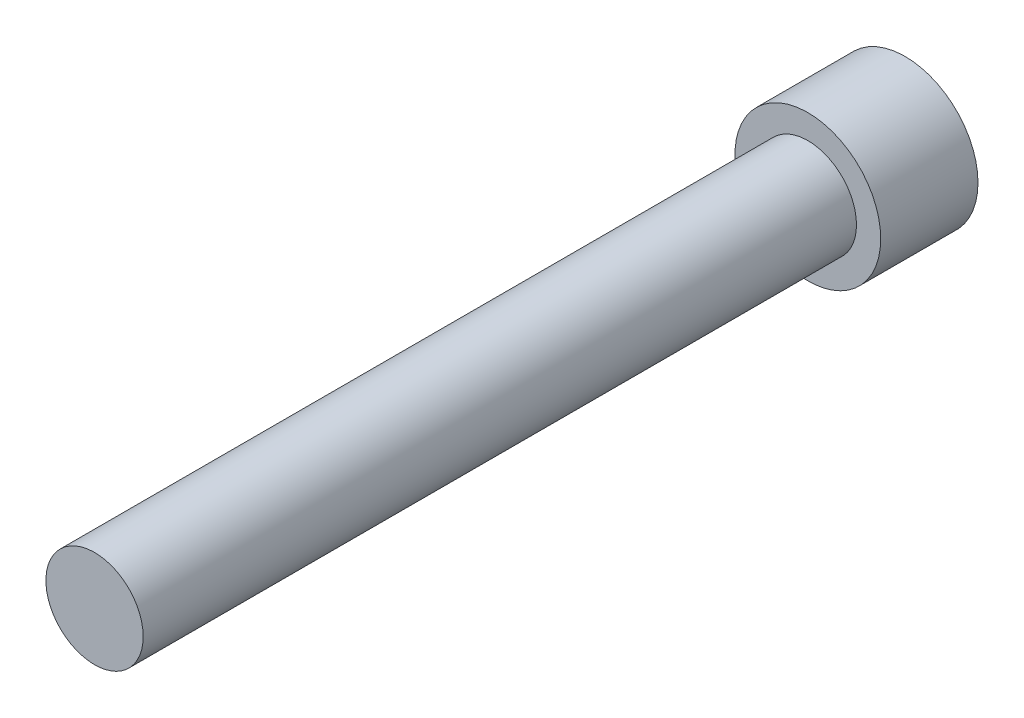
from build123d import *

# Parameters (mm, degrees)
HEX_2_DEPTH = 5.842


with BuildPart() as part:
    # Sketch6 → Revolve1 (revolve)
    with BuildSketch(Plane(origin=(0, 0, 0), x_dir=(0, 0, -1), z_dir=(1, 0, 0)), mode=Mode.PRIVATE) as revolve1_sk:
        Polygon((-69.85, 0), (-69.85, -4.7625), (0, -4.7625), (0, -7.1374), (9.525, -7.1374), (9.525, 0), align=None)
    revolve(revolve1_sk.sketch.rotate(Axis((0, 0, 69.85), (0, 0, -1)), 270), axis=Axis((0, 0, 69.85), (0, 0, -1)))

    # Sketch7 → HEX 2 (cut)
    with BuildSketch(Plane(origin=(0, 0, -9.525), x_dir=(-1, 0, 0), z_dir=(0, 0, -1))):
        Polygon((-3.9624, 2.287692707), (-3.9624, -2.287692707), (0, -4.575385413), (3.9624, -2.287692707), (3.9624, 2.287692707), (0, 4.575385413), align=None)
    extrude(amount=-HEX_2_DEPTH, mode=Mode.SUBTRACT)


solid = part.part
